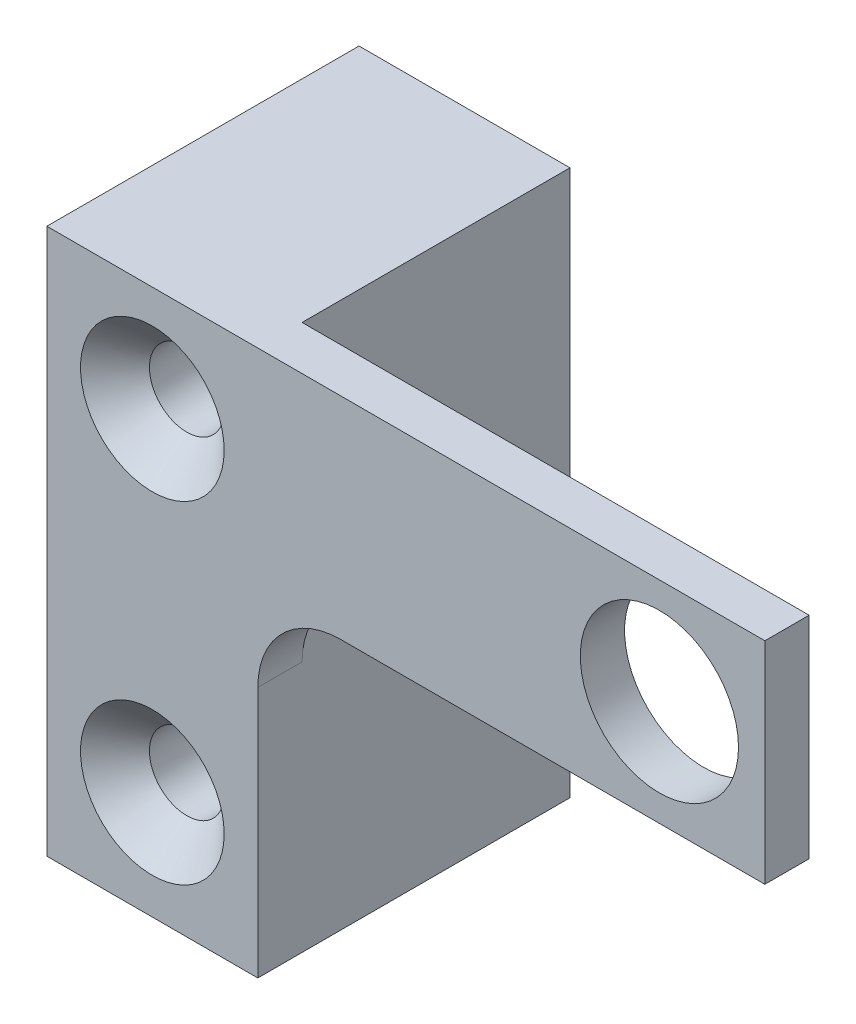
from build123d import *

# Parameters (mm, degrees)
SKETCH1_W                                       = 25.4
SKETCH1_H                                       = 65.7
BOSS_EXTRUDE1_DEPTH                             = 32.26
SKETCH2_W                                       = 86.46
SKETCH2_H                                       = 25.4
BOSS_EXTRUDE2_DEPTH                             = 5.33
SKETCH3_W                                       = 25.4
SKETCH3_H                                       = 40.3
BOSS_EXTRUDE3_DEPTH                             = 5.33
SKETCH4_R                                       = 9.525
CUT_EXTRUDE1_DEPTH                              = 115.91226958
CSK_FOR_M8_FLAT_HEAD_MACHINE_SCREW1_D           = 9
CSK_FOR_M8_FLAT_HEAD_MACHINE_SCREW1_CSINK_D     = 17.3
CSK_FOR_M8_FLAT_HEAD_MACHINE_SCREW1_CSINK_ANGLE = 90
FILLET1_R                                       = 10


with BuildPart() as part:
    # Sketch1 → Boss-Extrude1 (new body)
    with BuildSketch(Plane.XY):
        with Locations((12.7, -32.85)):
            Rectangle(SKETCH1_W, SKETCH1_H)
    extrude(amount=BOSS_EXTRUDE1_DEPTH)

    # Sketch2 → Boss-Extrude2 (add)
    with BuildSketch(Plane.XY.offset(32.26)):
        with Locations((43.23, -12.7)):
            Rectangle(SKETCH2_W, SKETCH2_H)
    extrude(amount=BOSS_EXTRUDE2_DEPTH)

    # Sketch3 → Boss-Extrude3 (add)
    with BuildSketch(Plane.XY.offset(32.26)):
        with Locations((12.7, -45.55)):
            Rectangle(SKETCH3_W, SKETCH3_H)
    extrude(amount=BOSS_EXTRUDE3_DEPTH)

    # Sketch4 → Cut-Extrude1 (cut, through all)
    with BuildSketch(Plane.XY.offset(37.59)):
        with Locations((73.76, -12.7)):
            Circle(SKETCH4_R)
    extrude(amount=-CUT_EXTRUDE1_DEPTH, mode=Mode.SUBTRACT)

    # CSK for M8 Flat Head Machine Screw1 (through all)
    with Locations(Plane.XY.offset(37.59)):
        with Locations((12.7, -12.7), (12.7, -52.7)):
            CounterSinkHole(CSK_FOR_M8_FLAT_HEAD_MACHINE_SCREW1_D / 2, CSK_FOR_M8_FLAT_HEAD_MACHINE_SCREW1_CSINK_D / 2, counter_sink_angle=CSK_FOR_M8_FLAT_HEAD_MACHINE_SCREW1_CSINK_ANGLE)

    # Fillet1
    fillet1_edges = [part.edges().sort_by_distance(p)[0] for p in [
        (25.4, -25.4, 34.925),
    ]]
    fillet(fillet1_edges, radius=FILLET1_R)


solid = part.part
